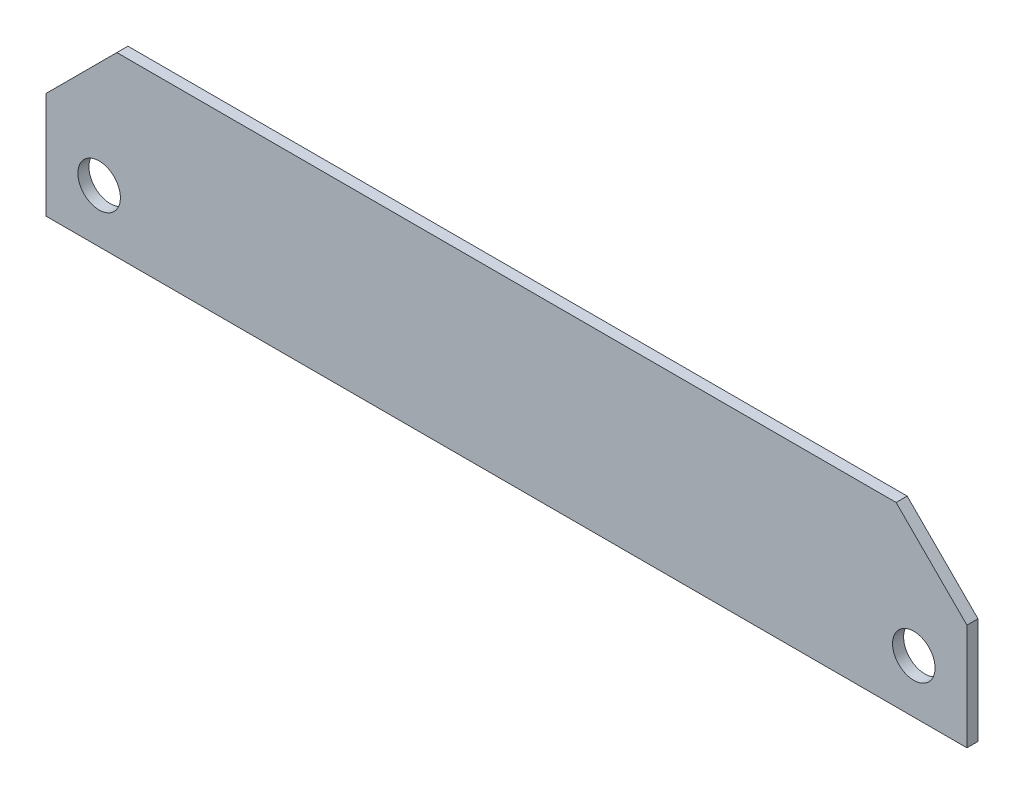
from build123d import *

# Parameters (mm, degrees)
SKETCH1_W          = 66.04
SKETCH1_H          = 12.7
EXTRUDE1_DEPTH     = 0.79375
SKETCH2_R          = 1.524
CUT_EXTRUDE1_DEPTH = 68.254751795
CHAMFER1_SIZE      = 5.08


with BuildPart() as part:
    # Sketch1 → Extrude1 (new body)
    with BuildSketch(Plane.XY):
        with Locations((33.02, 6.35)):
            Rectangle(SKETCH1_W, SKETCH1_H)
    extrude(amount=EXTRUDE1_DEPTH)

    # Sketch2 → Cut-Extrude1 (cut, through all)
    with BuildSketch(Plane.XY.offset(0.79375)):
        with Locations((3.81, 3.81)):
            Circle(SKETCH2_R)
        with Locations(Location((62.23, 3.81, 0), (0, 0, 180))):
            Circle(SKETCH2_R)
    extrude(amount=-CUT_EXTRUDE1_DEPTH, mode=Mode.SUBTRACT)

    # Chamfer1
    chamfer1_edges = [part.edges().sort_by_distance(p)[0] for p in [
        (0, 12.7, 0.396875),
        (66.04, 12.7, 0.396875),
    ]]
    chamfer(chamfer1_edges, length=CHAMFER1_SIZE)


solid = part.part
